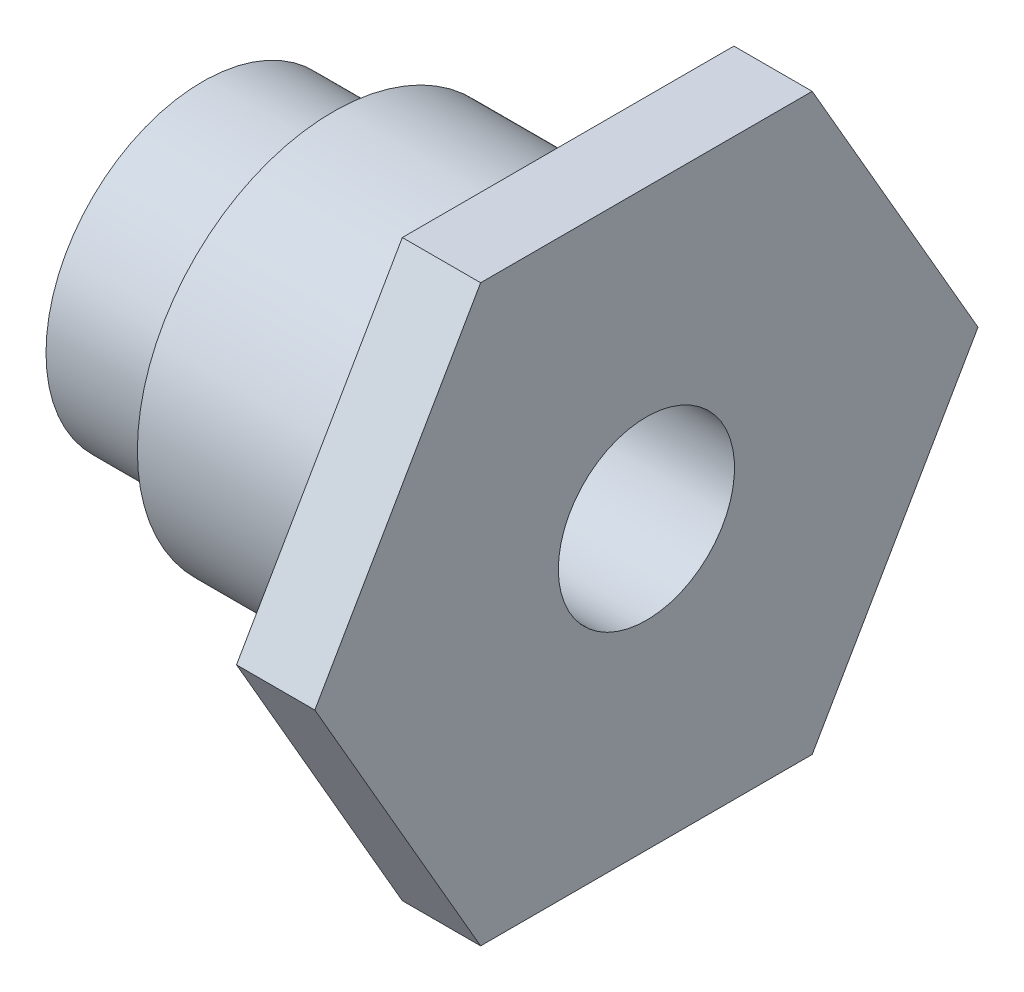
ISO-10303-21;
HEADER;
FILE_DESCRIPTION(('STEP AP214'),'2;1');
FILE_NAME('part.step','',(''),(''),'','','');
FILE_SCHEMA(('AUTOMOTIVE_DESIGN { 1 0 10303 214 1 1 1 1 }'));
ENDSEC;
DATA;
#1=APPLICATION_CONTEXT('core data for automotive mechanical design processes');
#2=APPLICATION_PROTOCOL_DEFINITION('international standard','automotive_design',2000,#1);
#3=PRODUCT_CONTEXT('',#1,'mechanical');
#4=PRODUCT('Part','Part','',(#3));
#5=PRODUCT_RELATED_PRODUCT_CATEGORY('part','',(#4));
#6=PRODUCT_DEFINITION_FORMATION('','',#4);
#7=PRODUCT_DEFINITION_CONTEXT('part definition',#1,'design');
#8=PRODUCT_DEFINITION('design','',#6,#7);
#9=PRODUCT_DEFINITION_SHAPE('','',#8);
#10=(LENGTH_UNIT() NAMED_UNIT(*) SI_UNIT(.MILLI.,.METRE.));
#11=(NAMED_UNIT(*) PLANE_ANGLE_UNIT() SI_UNIT($,.RADIAN.));
#12=(NAMED_UNIT(*) SI_UNIT($,.STERADIAN.) SOLID_ANGLE_UNIT());
#13=UNCERTAINTY_MEASURE_WITH_UNIT(LENGTH_MEASURE(1.E-05),#10,'distance_accuracy_value','');
#14=(GEOMETRIC_REPRESENTATION_CONTEXT(3) GLOBAL_UNCERTAINTY_ASSIGNED_CONTEXT((#13)) GLOBAL_UNIT_ASSIGNED_CONTEXT((#10,
#11,#12)) REPRESENTATION_CONTEXT('',''));
#15=CARTESIAN_POINT('',(0.,0.,0.));
#16=DIRECTION('',(0.,0.,1.));
#17=DIRECTION('',(1.,0.,0.));
#18=AXIS2_PLACEMENT_3D('',#15,#16,#17);
#19=CARTESIAN_POINT('',(14.,7.5,0.));
#20=DIRECTION('',(1.,0.,0.));
#21=DIRECTION('',(0.,0.,-1.));
#22=AXIS2_PLACEMENT_3D('',#19,#20,#21);
#23=PLANE('',#22);
#24=CARTESIAN_POINT('',(14.,0.,0.));
#25=DIRECTION('',(-1.,0.,0.));
#26=DIRECTION('',(0.,0.,1.));
#27=AXIS2_PLACEMENT_3D('',#24,#25,#26);
#28=CIRCLE('',#27,7.5);
#29=CARTESIAN_POINT('',(14.,0.,7.5));
#30=VERTEX_POINT('',#29);
#31=EDGE_CURVE('E139',#30,#30,#28,.T.);
#32=ORIENTED_EDGE('',*,*,#31,.F.);
#33=EDGE_LOOP('',(#32));
#34=FACE_BOUND('',#33,.T.);
#35=DIRECTION('',(0.,0.866025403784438,0.5));
#36=VECTOR('',#35,1.);
#37=CARTESIAN_POINT('',(14.,11.125,-6.27868417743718));
#38=LINE('',#37,#36);
#39=CARTESIAN_POINT('',(14.,0.,-12.7017059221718));
#40=VERTEX_POINT('',#39);
#41=CARTESIAN_POINT('',(14.,11.,-6.35085296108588));
#42=VERTEX_POINT('',#41);
#43=EDGE_CURVE('E131',#40,#42,#38,.T.);
#44=ORIENTED_EDGE('',*,*,#43,.F.);
#45=DIRECTION('',(0.,0.866025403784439,-0.5));
#46=VECTOR('',#45,1.);
#47=CARTESIAN_POINT('',(14.,0.125,-12.7738747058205));
#48=LINE('',#47,#46);
#49=CARTESIAN_POINT('',(14.,-11.,-6.35085296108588));
#50=VERTEX_POINT('',#49);
#51=EDGE_CURVE('E129',#50,#40,#48,.T.);
#52=ORIENTED_EDGE('',*,*,#51,.F.);
#53=DIRECTION('',(0.,0.,-1.));
#54=VECTOR('',#53,1.);
#55=CARTESIAN_POINT('',(14.,-11.,0.));
#56=LINE('',#55,#54);
#57=CARTESIAN_POINT('',(14.,-11.,6.35085296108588));
#58=VERTEX_POINT('',#57);
#59=EDGE_CURVE('E127',#58,#50,#56,.T.);
#60=ORIENTED_EDGE('',*,*,#59,.F.);
#61=DIRECTION('',(0.,-0.866025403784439,-0.5));
#62=VECTOR('',#61,1.);
#63=CARTESIAN_POINT('',(14.,0.124999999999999,12.7738747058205));
#64=LINE('',#63,#62);
#65=CARTESIAN_POINT('',(14.,0.,12.7017059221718));
#66=VERTEX_POINT('',#65);
#67=EDGE_CURVE('E125',#66,#58,#64,.T.);
#68=ORIENTED_EDGE('',*,*,#67,.F.);
#69=DIRECTION('',(0.,-0.866025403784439,0.5));
#70=VECTOR('',#69,1.);
#71=CARTESIAN_POINT('',(14.,11.125,6.27868417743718));
#72=LINE('',#71,#70);
#73=CARTESIAN_POINT('',(14.,11.,6.35085296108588));
#74=VERTEX_POINT('',#73);
#75=EDGE_CURVE('E87',#74,#66,#72,.T.);
#76=ORIENTED_EDGE('',*,*,#75,.F.);
#77=DIRECTION('',(0.,0.,1.));
#78=VECTOR('',#77,1.);
#79=CARTESIAN_POINT('',(14.,11.,0.));
#80=LINE('',#79,#78);
#81=EDGE_CURVE('E117',#42,#74,#80,.T.);
#82=ORIENTED_EDGE('',*,*,#81,.F.);
#83=EDGE_LOOP('',(#44,#52,#60,#68,#76,#82));
#84=FACE_BOUND('',#83,.T.);
#85=ADVANCED_FACE('F31',(#34,#84),#23,.F.);
#86=CARTESIAN_POINT('',(17.,17.5,0.));
#87=DIRECTION('',(-1.,0.,0.));
#88=DIRECTION('',(0.,0.,1.));
#89=AXIS2_PLACEMENT_3D('',#86,#87,#88);
#90=PLANE('',#89);
#91=CARTESIAN_POINT('',(17.,0.,0.));
#92=DIRECTION('',(-1.,0.,0.));
#93=DIRECTION('',(0.,0.,1.));
#94=AXIS2_PLACEMENT_3D('',#91,#92,#93);
#95=CIRCLE('',#94,3.375);
#96=CARTESIAN_POINT('',(17.,0.,3.375));
#97=VERTEX_POINT('',#96);
#98=EDGE_CURVE('E136',#97,#97,#95,.T.);
#99=ORIENTED_EDGE('',*,*,#98,.T.);
#100=EDGE_LOOP('',(#99));
#101=FACE_BOUND('',#100,.T.);
#102=DIRECTION('',(0.,0.866025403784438,0.5));
#103=VECTOR('',#102,1.);
#104=CARTESIAN_POINT('',(17.,0.,-12.7017059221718));
#105=LINE('',#104,#103);
#106=CARTESIAN_POINT('',(17.,0.,-12.7017059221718));
#107=VERTEX_POINT('',#106);
#108=CARTESIAN_POINT('',(17.,11.,-6.35085296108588));
#109=VERTEX_POINT('',#108);
#110=EDGE_CURVE('E107',#107,#109,#105,.T.);
#111=ORIENTED_EDGE('',*,*,#110,.T.);
#112=DIRECTION('',(0.,0.,1.));
#113=VECTOR('',#112,1.);
#114=CARTESIAN_POINT('',(17.,11.,-6.35085296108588));
#115=LINE('',#114,#113);
#116=CARTESIAN_POINT('',(17.,11.,6.35085296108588));
#117=VERTEX_POINT('',#116);
#118=EDGE_CURVE('E105',#109,#117,#115,.T.);
#119=ORIENTED_EDGE('',*,*,#118,.T.);
#120=DIRECTION('',(0.,-0.866025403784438,0.5));
#121=VECTOR('',#120,1.);
#122=CARTESIAN_POINT('',(17.,11.,6.35085296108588));
#123=LINE('',#122,#121);
#124=CARTESIAN_POINT('',(17.,0.,12.7017059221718));
#125=VERTEX_POINT('',#124);
#126=EDGE_CURVE('E54',#117,#125,#123,.T.);
#127=ORIENTED_EDGE('',*,*,#126,.T.);
#128=DIRECTION('',(0.,-0.866025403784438,-0.5));
#129=VECTOR('',#128,1.);
#130=CARTESIAN_POINT('',(17.,0.,12.7017059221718));
#131=LINE('',#130,#129);
#132=CARTESIAN_POINT('',(17.,-11.,6.35085296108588));
#133=VERTEX_POINT('',#132);
#134=EDGE_CURVE('E94',#125,#133,#131,.T.);
#135=ORIENTED_EDGE('',*,*,#134,.T.);
#136=DIRECTION('',(0.,0.,-1.));
#137=VECTOR('',#136,1.);
#138=CARTESIAN_POINT('',(17.,-11.,6.35085296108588));
#139=LINE('',#138,#137);
#140=CARTESIAN_POINT('',(17.,-11.,-6.35085296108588));
#141=VERTEX_POINT('',#140);
#142=EDGE_CURVE('E100',#133,#141,#139,.T.);
#143=ORIENTED_EDGE('',*,*,#142,.T.);
#144=DIRECTION('',(0.,0.866025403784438,-0.5));
#145=VECTOR('',#144,1.);
#146=CARTESIAN_POINT('',(17.,-11.,-6.35085296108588));
#147=LINE('',#146,#145);
#148=EDGE_CURVE('E112',#141,#107,#147,.T.);
#149=ORIENTED_EDGE('',*,*,#148,.T.);
#150=EDGE_LOOP('',(#111,#119,#127,#135,#143,#149));
#151=FACE_BOUND('',#150,.T.);
#152=ADVANCED_FACE('F104',(#101,#151),#90,.F.);
#153=CARTESIAN_POINT('',(0.,3.375,0.));
#154=DIRECTION('',(1.,0.,0.));
#155=DIRECTION('',(0.,0.,-1.));
#156=AXIS2_PLACEMENT_3D('',#153,#154,#155);
#157=PLANE('',#156);
#158=CARTESIAN_POINT('',(0.,0.,0.));
#159=DIRECTION('',(-1.,0.,0.));
#160=DIRECTION('',(0.,0.,1.));
#161=AXIS2_PLACEMENT_3D('',#158,#159,#160);
#162=CIRCLE('',#161,3.375);
#163=CARTESIAN_POINT('',(0.,0.,3.375));
#164=VERTEX_POINT('',#163);
#165=EDGE_CURVE('E133',#164,#164,#162,.T.);
#166=ORIENTED_EDGE('',*,*,#165,.F.);
#167=EDGE_LOOP('',(#166));
#168=FACE_BOUND('',#167,.T.);
#169=CARTESIAN_POINT('',(0.,0.,0.));
#170=DIRECTION('',(-1.,0.,0.));
#171=DIRECTION('',(0.,0.,1.));
#172=AXIS2_PLACEMENT_3D('',#169,#170,#171);
#173=CIRCLE('',#172,6.);
#174=CARTESIAN_POINT('',(0.,0.,6.));
#175=VERTEX_POINT('',#174);
#176=EDGE_CURVE('E11',#175,#175,#173,.T.);
#177=ORIENTED_EDGE('',*,*,#176,.T.);
#178=EDGE_LOOP('',(#177));
#179=FACE_BOUND('',#178,.T.);
#180=ADVANCED_FACE('F33',(#168,#179),#157,.F.);
#181=CARTESIAN_POINT('',(0.,0.,0.));
#182=DIRECTION('',(-1.,0.,0.));
#183=DIRECTION('',(0.,0.,1.));
#184=AXIS2_PLACEMENT_3D('',#181,#182,#183);
#185=CYLINDRICAL_SURFACE('',#184,6.);
#186=ORIENTED_EDGE('',*,*,#176,.F.);
#187=EDGE_LOOP('',(#186));
#188=FACE_BOUND('',#187,.T.);
#189=CARTESIAN_POINT('',(5.,0.,0.));
#190=DIRECTION('',(-1.,0.,0.));
#191=DIRECTION('',(0.,0.,1.));
#192=AXIS2_PLACEMENT_3D('',#189,#190,#191);
#193=CIRCLE('',#192,6.);
#194=CARTESIAN_POINT('',(5.,0.,6.));
#195=VERTEX_POINT('',#194);
#196=EDGE_CURVE('E39',#195,#195,#193,.T.);
#197=ORIENTED_EDGE('',*,*,#196,.T.);
#198=EDGE_LOOP('',(#197));
#199=FACE_BOUND('',#198,.T.);
#200=ADVANCED_FACE('F147',(#188,#199),#185,.T.);
#201=CARTESIAN_POINT('',(5.,6.,0.));
#202=DIRECTION('',(1.,0.,0.));
#203=DIRECTION('',(0.,0.,-1.));
#204=AXIS2_PLACEMENT_3D('',#201,#202,#203);
#205=PLANE('',#204);
#206=ORIENTED_EDGE('',*,*,#196,.F.);
#207=EDGE_LOOP('',(#206));
#208=FACE_BOUND('',#207,.T.);
#209=CARTESIAN_POINT('',(5.,0.,0.));
#210=DIRECTION('',(-1.,0.,0.));
#211=DIRECTION('',(0.,0.,1.));
#212=AXIS2_PLACEMENT_3D('',#209,#210,#211);
#213=CIRCLE('',#212,7.5);
#214=CARTESIAN_POINT('',(5.,0.,7.5));
#215=VERTEX_POINT('',#214);
#216=EDGE_CURVE('E142',#215,#215,#213,.T.);
#217=ORIENTED_EDGE('',*,*,#216,.T.);
#218=EDGE_LOOP('',(#217));
#219=FACE_BOUND('',#218,.T.);
#220=ADVANCED_FACE('F149',(#208,#219),#205,.F.);
#221=CARTESIAN_POINT('',(0.,0.,0.));
#222=DIRECTION('',(-1.,0.,0.));
#223=DIRECTION('',(0.,0.,1.));
#224=AXIS2_PLACEMENT_3D('',#221,#222,#223);
#225=CYLINDRICAL_SURFACE('',#224,7.5);
#226=ORIENTED_EDGE('',*,*,#216,.F.);
#227=EDGE_LOOP('',(#226));
#228=FACE_BOUND('',#227,.T.);
#229=ORIENTED_EDGE('',*,*,#31,.T.);
#230=EDGE_LOOP('',(#229));
#231=FACE_BOUND('',#230,.T.);
#232=ADVANCED_FACE('F152',(#228,#231),#225,.T.);
#233=CARTESIAN_POINT('',(0.,0.,0.));
#234=DIRECTION('',(-1.,0.,0.));
#235=DIRECTION('',(0.,0.,1.));
#236=AXIS2_PLACEMENT_3D('',#233,#234,#235);
#237=CYLINDRICAL_SURFACE('',#236,3.375);
#238=ORIENTED_EDGE('',*,*,#98,.F.);
#239=EDGE_LOOP('',(#238));
#240=FACE_BOUND('',#239,.T.);
#241=ORIENTED_EDGE('',*,*,#165,.T.);
#242=EDGE_LOOP('',(#241));
#243=FACE_BOUND('',#242,.T.);
#244=ADVANCED_FACE('F158',(#240,#243),#237,.F.);
#245=CARTESIAN_POINT('',(0.,0.,-12.7017059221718));
#246=DIRECTION('',(0.,0.5,-0.866025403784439));
#247=DIRECTION('',(0.,0.866025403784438,0.5));
#248=AXIS2_PLACEMENT_3D('',#245,#246,#247);
#249=PLANE('',#248);
#250=ORIENTED_EDGE('',*,*,#43,.T.);
#251=DIRECTION('',(1.,0.,0.));
#252=VECTOR('',#251,1.);
#253=CARTESIAN_POINT('',(0.,11.,-6.35085296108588));
#254=LINE('',#253,#252);
#255=EDGE_CURVE('E46',#42,#109,#254,.T.);
#256=ORIENTED_EDGE('',*,*,#255,.T.);
#257=ORIENTED_EDGE('',*,*,#110,.F.);
#258=DIRECTION('',(1.,0.,0.));
#259=VECTOR('',#258,1.);
#260=CARTESIAN_POINT('',(0.,0.,-12.7017059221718));
#261=LINE('',#260,#259);
#262=EDGE_CURVE('E115',#40,#107,#261,.T.);
#263=ORIENTED_EDGE('',*,*,#262,.F.);
#264=EDGE_LOOP('',(#250,#256,#257,#263));
#265=FACE_BOUND('',#264,.T.);
#266=ADVANCED_FACE('F171',(#265),#249,.T.);
#267=CARTESIAN_POINT('',(0.,-11.,-6.35085296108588));
#268=DIRECTION('',(0.,-0.5,-0.866025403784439));
#269=DIRECTION('',(0.,0.866025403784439,-0.5));
#270=AXIS2_PLACEMENT_3D('',#267,#268,#269);
#271=PLANE('',#270);
#272=ORIENTED_EDGE('',*,*,#51,.T.);
#273=ORIENTED_EDGE('',*,*,#262,.T.);
#274=ORIENTED_EDGE('',*,*,#148,.F.);
#275=DIRECTION('',(1.,0.,0.));
#276=VECTOR('',#275,1.);
#277=CARTESIAN_POINT('',(0.,-11.,-6.35085296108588));
#278=LINE('',#277,#276);
#279=EDGE_CURVE('E118',#50,#141,#278,.T.);
#280=ORIENTED_EDGE('',*,*,#279,.F.);
#281=EDGE_LOOP('',(#272,#273,#274,#280));
#282=FACE_BOUND('',#281,.T.);
#283=ADVANCED_FACE('F175',(#282),#271,.T.);
#284=CARTESIAN_POINT('',(0.,-11.,6.35085296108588));
#285=DIRECTION('',(0.,-1.,0.));
#286=DIRECTION('',(0.,0.,-1.));
#287=AXIS2_PLACEMENT_3D('',#284,#285,#286);
#288=PLANE('',#287);
#289=ORIENTED_EDGE('',*,*,#59,.T.);
#290=ORIENTED_EDGE('',*,*,#279,.T.);
#291=ORIENTED_EDGE('',*,*,#142,.F.);
#292=DIRECTION('',(1.,0.,0.));
#293=VECTOR('',#292,1.);
#294=CARTESIAN_POINT('',(0.,-11.,6.35085296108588));
#295=LINE('',#294,#293);
#296=EDGE_CURVE('E90',#58,#133,#295,.T.);
#297=ORIENTED_EDGE('',*,*,#296,.F.);
#298=EDGE_LOOP('',(#289,#290,#291,#297));
#299=FACE_BOUND('',#298,.T.);
#300=ADVANCED_FACE('F178',(#299),#288,.T.);
#301=CARTESIAN_POINT('',(0.,0.,12.7017059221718));
#302=DIRECTION('',(0.,-0.5,0.866025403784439));
#303=DIRECTION('',(0.,-0.866025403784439,-0.5));
#304=AXIS2_PLACEMENT_3D('',#301,#302,#303);
#305=PLANE('',#304);
#306=ORIENTED_EDGE('',*,*,#67,.T.);
#307=ORIENTED_EDGE('',*,*,#296,.T.);
#308=ORIENTED_EDGE('',*,*,#134,.F.);
#309=DIRECTION('',(1.,0.,0.));
#310=VECTOR('',#309,1.);
#311=CARTESIAN_POINT('',(0.,0.,12.7017059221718));
#312=LINE('',#311,#310);
#313=EDGE_CURVE('E83',#66,#125,#312,.T.);
#314=ORIENTED_EDGE('',*,*,#313,.F.);
#315=EDGE_LOOP('',(#306,#307,#308,#314));
#316=FACE_BOUND('',#315,.T.);
#317=ADVANCED_FACE('F95',(#316),#305,.T.);
#318=CARTESIAN_POINT('',(0.,11.,6.35085296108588));
#319=DIRECTION('',(0.,0.5,0.866025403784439));
#320=DIRECTION('',(0.,-0.866025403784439,0.5));
#321=AXIS2_PLACEMENT_3D('',#318,#319,#320);
#322=PLANE('',#321);
#323=ORIENTED_EDGE('',*,*,#75,.T.);
#324=ORIENTED_EDGE('',*,*,#313,.T.);
#325=ORIENTED_EDGE('',*,*,#126,.F.);
#326=DIRECTION('',(1.,0.,0.));
#327=VECTOR('',#326,1.);
#328=CARTESIAN_POINT('',(0.,11.,6.35085296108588));
#329=LINE('',#328,#327);
#330=EDGE_CURVE('E91',#74,#117,#329,.T.);
#331=ORIENTED_EDGE('',*,*,#330,.F.);
#332=EDGE_LOOP('',(#323,#324,#325,#331));
#333=FACE_BOUND('',#332,.T.);
#334=ADVANCED_FACE('F85',(#333),#322,.T.);
#335=CARTESIAN_POINT('',(0.,11.,-6.35085296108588));
#336=DIRECTION('',(0.,1.,0.));
#337=DIRECTION('',(0.,0.,1.));
#338=AXIS2_PLACEMENT_3D('',#335,#336,#337);
#339=PLANE('',#338);
#340=ORIENTED_EDGE('',*,*,#81,.T.);
#341=ORIENTED_EDGE('',*,*,#330,.T.);
#342=ORIENTED_EDGE('',*,*,#118,.F.);
#343=ORIENTED_EDGE('',*,*,#255,.F.);
#344=EDGE_LOOP('',(#340,#341,#342,#343));
#345=FACE_BOUND('',#344,.T.);
#346=ADVANCED_FACE('F190',(#345),#339,.T.);
#347=CLOSED_SHELL('',(#85,#152,#180,#200,#220,#232,#244,#266,#283,#300,#317,#334,#346));
#348=MANIFOLD_SOLID_BREP('B2',#347);
#349=ADVANCED_BREP_SHAPE_REPRESENTATION('',(#18,#348),#14);
#350=SHAPE_DEFINITION_REPRESENTATION(#9,#349);
ENDSEC;
END-ISO-10303-21;
